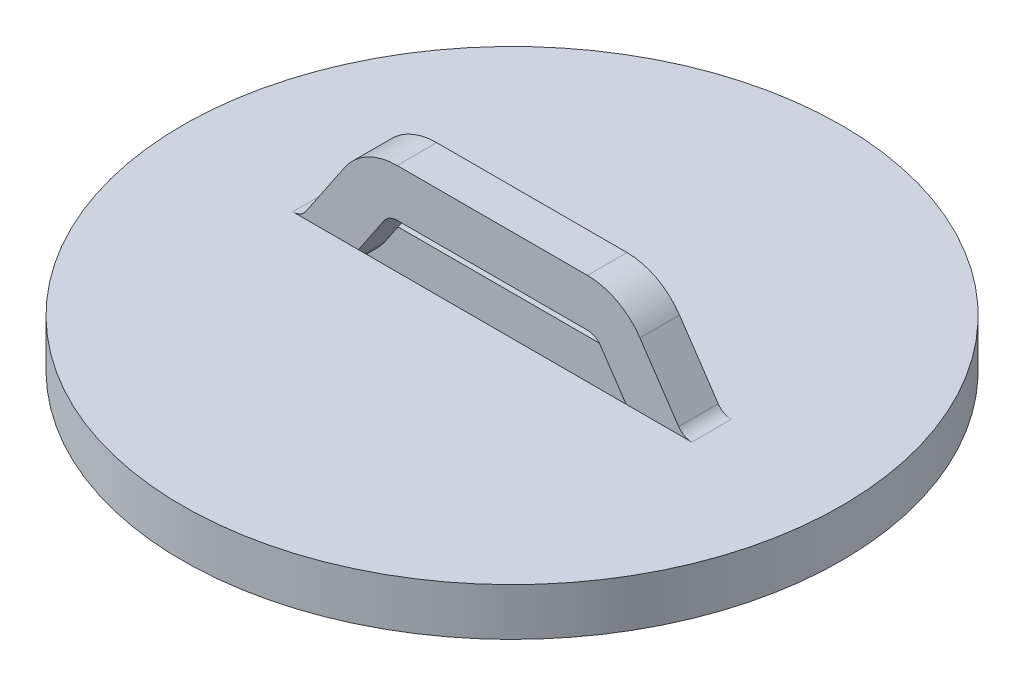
ISO-10303-21;
HEADER;
FILE_DESCRIPTION(('STEP AP214'),'2;1');
FILE_NAME('part.step','',(''),(''),'','','');
FILE_SCHEMA(('AUTOMOTIVE_DESIGN { 1 0 10303 214 1 1 1 1 }'));
ENDSEC;
DATA;
#1=APPLICATION_CONTEXT('core data for automotive mechanical design processes');
#2=APPLICATION_PROTOCOL_DEFINITION('international standard','automotive_design',2000,#1);
#3=PRODUCT_CONTEXT('',#1,'mechanical');
#4=PRODUCT('Part','Part','',(#3));
#5=PRODUCT_RELATED_PRODUCT_CATEGORY('part','',(#4));
#6=PRODUCT_DEFINITION_FORMATION('','',#4);
#7=PRODUCT_DEFINITION_CONTEXT('part definition',#1,'design');
#8=PRODUCT_DEFINITION('design','',#6,#7);
#9=PRODUCT_DEFINITION_SHAPE('','',#8);
#10=(LENGTH_UNIT() NAMED_UNIT(*) SI_UNIT(.MILLI.,.METRE.));
#11=(NAMED_UNIT(*) PLANE_ANGLE_UNIT() SI_UNIT($,.RADIAN.));
#12=(NAMED_UNIT(*) SI_UNIT($,.STERADIAN.) SOLID_ANGLE_UNIT());
#13=UNCERTAINTY_MEASURE_WITH_UNIT(LENGTH_MEASURE(1.E-05),#10,'distance_accuracy_value','');
#14=(GEOMETRIC_REPRESENTATION_CONTEXT(3) GLOBAL_UNCERTAINTY_ASSIGNED_CONTEXT((#13)) GLOBAL_UNIT_ASSIGNED_CONTEXT((#10,
#11,#12)) REPRESENTATION_CONTEXT('',''));
#15=CARTESIAN_POINT('',(0.,0.,0.));
#16=DIRECTION('',(0.,0.,1.));
#17=DIRECTION('',(1.,0.,0.));
#18=AXIS2_PLACEMENT_3D('',#15,#16,#17);
#19=CARTESIAN_POINT('',(-9.60870329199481,0.762,1.905));
#20=DIRECTION('',(0.,0.,-1.));
#21=DIRECTION('',(-1.,0.,0.));
#22=AXIS2_PLACEMENT_3D('',#19,#20,#21);
#23=PLANE('',#22);
#24=DIRECTION('',(-1.,0.,0.));
#25=VECTOR('',#24,1.);
#26=CARTESIAN_POINT('',(-9.60870329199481,0.,1.905));
#27=LINE('',#26,#25);
#28=CARTESIAN_POINT('',(-6.44612647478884,0.,1.905));
#29=VERTEX_POINT('',#28);
#30=CARTESIAN_POINT('',(-9.60870329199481,0.,1.905));
#31=VERTEX_POINT('',#30);
#32=EDGE_CURVE('E60',#29,#31,#27,.T.);
#33=ORIENTED_EDGE('',*,*,#32,.F.);
#34=DIRECTION('',(0.559192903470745,0.829037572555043,0.));
#35=VECTOR('',#34,1.);
#36=CARTESIAN_POINT('',(-7.08179677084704,-0.942419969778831,1.905));
#37=LINE('',#36,#35);
#38=CARTESIAN_POINT('',(-5.21642663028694,1.82310499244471,1.905));
#39=VERTEX_POINT('',#38);
#40=EDGE_CURVE('E267',#29,#39,#37,.T.);
#41=ORIENTED_EDGE('',*,*,#40,.T.);
#42=CARTESIAN_POINT('',(-4.5847,1.397,1.905));
#43=DIRECTION('',(0.,0.,-1.));
#44=DIRECTION('',(-1.,0.,0.));
#45=AXIS2_PLACEMENT_3D('',#42,#43,#44);
#46=CIRCLE('',#45,0.761999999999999);
#47=CARTESIAN_POINT('',(-4.5847,2.159,1.905));
#48=VERTEX_POINT('',#47);
#49=EDGE_CURVE('E270',#39,#48,#46,.T.);
#50=ORIENTED_EDGE('',*,*,#49,.T.);
#51=DIRECTION('',(1.,0.,0.));
#52=VECTOR('',#51,1.);
#53=CARTESIAN_POINT('',(-4.5847,2.159,1.905));
#54=LINE('',#53,#52);
#55=CARTESIAN_POINT('',(4.5847,2.159,1.905));
#56=VERTEX_POINT('',#55);
#57=EDGE_CURVE('E272',#48,#56,#54,.T.);
#58=ORIENTED_EDGE('',*,*,#57,.T.);
#59=CARTESIAN_POINT('',(4.5847,1.397,1.905));
#60=DIRECTION('',(0.,0.,-1.));
#61=DIRECTION('',(-1.,0.,0.));
#62=AXIS2_PLACEMENT_3D('',#59,#60,#61);
#63=CIRCLE('',#62,0.762);
#64=CARTESIAN_POINT('',(5.21642663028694,1.82310499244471,1.905));
#65=VERTEX_POINT('',#64);
#66=EDGE_CURVE('E274',#56,#65,#63,.T.);
#67=ORIENTED_EDGE('',*,*,#66,.T.);
#68=DIRECTION('',(0.559192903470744,-0.829037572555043,0.));
#69=VECTOR('',#68,1.);
#70=CARTESIAN_POINT('',(5.21642663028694,1.82310499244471,1.905));
#71=LINE('',#70,#69);
#72=CARTESIAN_POINT('',(6.44612647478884,0.,1.905));
#73=VERTEX_POINT('',#72);
#74=EDGE_CURVE('E276',#65,#73,#71,.T.);
#75=ORIENTED_EDGE('',*,*,#74,.T.);
#76=CARTESIAN_POINT('',(9.60870329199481,0.,1.905));
#77=VERTEX_POINT('',#76);
#78=EDGE_CURVE('E265',#77,#73,#27,.T.);
#79=ORIENTED_EDGE('',*,*,#78,.F.);
#80=CARTESIAN_POINT('',(9.60870329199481,0.762,1.905));
#81=DIRECTION('',(0.,0.,-1.));
#82=DIRECTION('',(1.,0.,0.));
#83=AXIS2_PLACEMENT_3D('',#80,#81,#82);
#84=CIRCLE('',#83,0.762);
#85=CARTESIAN_POINT('',(8.97697666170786,0.335895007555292,1.905));
#86=VERTEX_POINT('',#85);
#87=EDGE_CURVE('E279',#77,#86,#84,.T.);
#88=ORIENTED_EDGE('',*,*,#87,.T.);
#89=DIRECTION('',(-0.559192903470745,0.829037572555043,0.));
#90=VECTOR('',#89,1.);
#91=CARTESIAN_POINT('',(7.11160652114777,3.10141996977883,1.905));
#92=LINE('',#91,#90);
#93=CARTESIAN_POINT('',(7.11160652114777,3.10141996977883,1.905));
#94=VERTEX_POINT('',#93);
#95=EDGE_CURVE('E281',#86,#94,#92,.T.);
#96=ORIENTED_EDGE('',*,*,#95,.T.);
#97=CARTESIAN_POINT('',(4.5847,1.397,1.905));
#98=DIRECTION('',(0.,0.,1.));
#99=DIRECTION('',(-1.,0.,0.));
#100=AXIS2_PLACEMENT_3D('',#97,#98,#99);
#101=CIRCLE('',#100,3.048);
#102=CARTESIAN_POINT('',(4.5847,4.445,1.905));
#103=VERTEX_POINT('',#102);
#104=EDGE_CURVE('E283',#94,#103,#101,.T.);
#105=ORIENTED_EDGE('',*,*,#104,.T.);
#106=DIRECTION('',(-1.,0.,0.));
#107=VECTOR('',#106,1.);
#108=CARTESIAN_POINT('',(-4.5847,4.445,1.905));
#109=LINE('',#108,#107);
#110=CARTESIAN_POINT('',(-4.5847,4.445,1.905));
#111=VERTEX_POINT('',#110);
#112=EDGE_CURVE('E285',#103,#111,#109,.T.);
#113=ORIENTED_EDGE('',*,*,#112,.T.);
#114=CARTESIAN_POINT('',(-4.5847,1.397,1.905));
#115=DIRECTION('',(0.,0.,1.));
#116=DIRECTION('',(-1.,0.,0.));
#117=AXIS2_PLACEMENT_3D('',#114,#115,#116);
#118=CIRCLE('',#117,3.048);
#119=CARTESIAN_POINT('',(-7.11160652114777,3.10141996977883,1.905));
#120=VERTEX_POINT('',#119);
#121=EDGE_CURVE('E287',#111,#120,#118,.T.);
#122=ORIENTED_EDGE('',*,*,#121,.T.);
#123=DIRECTION('',(-0.559192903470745,-0.829037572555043,0.));
#124=VECTOR('',#123,1.);
#125=CARTESIAN_POINT('',(-8.97697666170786,0.335895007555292,1.905));
#126=LINE('',#125,#124);
#127=CARTESIAN_POINT('',(-8.97697666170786,0.335895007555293,1.905));
#128=VERTEX_POINT('',#127);
#129=EDGE_CURVE('E195',#120,#128,#126,.T.);
#130=ORIENTED_EDGE('',*,*,#129,.T.);
#131=CARTESIAN_POINT('',(-9.60870329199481,0.762,1.905));
#132=DIRECTION('',(0.,0.,-1.));
#133=DIRECTION('',(-1.,0.,0.));
#134=AXIS2_PLACEMENT_3D('',#131,#132,#133);
#135=CIRCLE('',#134,0.762);
#136=EDGE_CURVE('E191',#128,#31,#135,.T.);
#137=ORIENTED_EDGE('',*,*,#136,.T.);
#138=EDGE_LOOP('',(#33,#41,#50,#58,#67,#75,#79,#88,#96,#105,#113,#122,#130,#137));
#139=FACE_BOUND('',#138,.T.);
#140=ADVANCED_FACE('F37',(#139),#23,.F.);
#141=CARTESIAN_POINT('',(-9.60870329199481,0.762,0.));
#142=DIRECTION('',(0.,0.,-1.));
#143=DIRECTION('',(-1.,0.,0.));
#144=AXIS2_PLACEMENT_3D('',#141,#142,#143);
#145=PLANE('',#144);
#146=DIRECTION('',(0.559192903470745,0.829037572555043,0.));
#147=VECTOR('',#146,1.);
#148=CARTESIAN_POINT('',(-7.08179677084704,-0.942419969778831,0.));
#149=LINE('',#148,#147);
#150=CARTESIAN_POINT('',(-6.44612647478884,0.,0.));
#151=VERTEX_POINT('',#150);
#152=CARTESIAN_POINT('',(-5.21642663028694,1.82310499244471,0.));
#153=VERTEX_POINT('',#152);
#154=EDGE_CURVE('E170',#151,#153,#149,.T.);
#155=ORIENTED_EDGE('',*,*,#154,.F.);
#156=DIRECTION('',(1.,0.,0.));
#157=VECTOR('',#156,1.);
#158=CARTESIAN_POINT('',(-9.60870329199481,0.,0.));
#159=LINE('',#158,#157);
#160=CARTESIAN_POINT('',(-9.60870329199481,0.,0.));
#161=VERTEX_POINT('',#160);
#162=EDGE_CURVE('E164',#161,#151,#159,.T.);
#163=ORIENTED_EDGE('',*,*,#162,.F.);
#164=CARTESIAN_POINT('',(-9.60870329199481,0.762,0.));
#165=DIRECTION('',(0.,0.,-1.));
#166=DIRECTION('',(-1.,0.,0.));
#167=AXIS2_PLACEMENT_3D('',#164,#165,#166);
#168=CIRCLE('',#167,0.762);
#169=CARTESIAN_POINT('',(-8.97697666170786,0.335895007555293,0.));
#170=VERTEX_POINT('',#169);
#171=EDGE_CURVE('E168',#170,#161,#168,.T.);
#172=ORIENTED_EDGE('',*,*,#171,.F.);
#173=DIRECTION('',(-0.559192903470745,-0.829037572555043,0.));
#174=VECTOR('',#173,1.);
#175=CARTESIAN_POINT('',(-8.97697666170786,0.335895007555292,0.));
#176=LINE('',#175,#174);
#177=CARTESIAN_POINT('',(-7.11160652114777,3.10141996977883,0.));
#178=VERTEX_POINT('',#177);
#179=EDGE_CURVE('E186',#178,#170,#176,.T.);
#180=ORIENTED_EDGE('',*,*,#179,.F.);
#181=CARTESIAN_POINT('',(-4.5847,1.397,0.));
#182=DIRECTION('',(0.,0.,1.));
#183=DIRECTION('',(-1.,0.,0.));
#184=AXIS2_PLACEMENT_3D('',#181,#182,#183);
#185=CIRCLE('',#184,3.048);
#186=CARTESIAN_POINT('',(-4.5847,4.445,0.));
#187=VERTEX_POINT('',#186);
#188=EDGE_CURVE('E314',#187,#178,#185,.T.);
#189=ORIENTED_EDGE('',*,*,#188,.F.);
#190=DIRECTION('',(-1.,0.,0.));
#191=VECTOR('',#190,1.);
#192=CARTESIAN_POINT('',(-4.5847,4.445,0.));
#193=LINE('',#192,#191);
#194=CARTESIAN_POINT('',(4.5847,4.445,0.));
#195=VERTEX_POINT('',#194);
#196=EDGE_CURVE('E312',#195,#187,#193,.T.);
#197=ORIENTED_EDGE('',*,*,#196,.F.);
#198=CARTESIAN_POINT('',(4.5847,1.397,0.));
#199=DIRECTION('',(0.,0.,1.));
#200=DIRECTION('',(-1.,0.,0.));
#201=AXIS2_PLACEMENT_3D('',#198,#199,#200);
#202=CIRCLE('',#201,3.048);
#203=CARTESIAN_POINT('',(7.11160652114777,3.10141996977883,0.));
#204=VERTEX_POINT('',#203);
#205=EDGE_CURVE('E310',#204,#195,#202,.T.);
#206=ORIENTED_EDGE('',*,*,#205,.F.);
#207=DIRECTION('',(-0.559192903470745,0.829037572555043,0.));
#208=VECTOR('',#207,1.);
#209=CARTESIAN_POINT('',(7.11160652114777,3.10141996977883,0.));
#210=LINE('',#209,#208);
#211=CARTESIAN_POINT('',(8.97697666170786,0.335895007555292,0.));
#212=VERTEX_POINT('',#211);
#213=EDGE_CURVE('E308',#212,#204,#210,.T.);
#214=ORIENTED_EDGE('',*,*,#213,.F.);
#215=CARTESIAN_POINT('',(9.60870329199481,0.762,0.));
#216=DIRECTION('',(0.,0.,-1.));
#217=DIRECTION('',(1.,0.,0.));
#218=AXIS2_PLACEMENT_3D('',#215,#216,#217);
#219=CIRCLE('',#218,0.762);
#220=CARTESIAN_POINT('',(9.60870329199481,0.,0.));
#221=VERTEX_POINT('',#220);
#222=EDGE_CURVE('E306',#221,#212,#219,.T.);
#223=ORIENTED_EDGE('',*,*,#222,.F.);
#224=DIRECTION('',(-1.,0.,0.));
#225=VECTOR('',#224,1.);
#226=CARTESIAN_POINT('',(-9.60870329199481,0.,0.));
#227=LINE('',#226,#225);
#228=CARTESIAN_POINT('',(6.44612647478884,0.,0.));
#229=VERTEX_POINT('',#228);
#230=EDGE_CURVE('E11',#221,#229,#227,.T.);
#231=ORIENTED_EDGE('',*,*,#230,.T.);
#232=DIRECTION('',(0.559192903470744,-0.829037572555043,0.));
#233=VECTOR('',#232,1.);
#234=CARTESIAN_POINT('',(5.21642663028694,1.82310499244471,0.));
#235=LINE('',#234,#233);
#236=CARTESIAN_POINT('',(5.21642663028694,1.82310499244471,0.));
#237=VERTEX_POINT('',#236);
#238=EDGE_CURVE('E300',#237,#229,#235,.T.);
#239=ORIENTED_EDGE('',*,*,#238,.F.);
#240=CARTESIAN_POINT('',(4.5847,1.397,0.));
#241=DIRECTION('',(0.,0.,-1.));
#242=DIRECTION('',(-1.,0.,0.));
#243=AXIS2_PLACEMENT_3D('',#240,#241,#242);
#244=CIRCLE('',#243,0.762);
#245=CARTESIAN_POINT('',(4.5847,2.159,0.));
#246=VERTEX_POINT('',#245);
#247=EDGE_CURVE('E297',#246,#237,#244,.T.);
#248=ORIENTED_EDGE('',*,*,#247,.F.);
#249=DIRECTION('',(1.,0.,0.));
#250=VECTOR('',#249,1.);
#251=CARTESIAN_POINT('',(-4.5847,2.159,0.));
#252=LINE('',#251,#250);
#253=CARTESIAN_POINT('',(-4.5847,2.159,0.));
#254=VERTEX_POINT('',#253);
#255=EDGE_CURVE('E295',#254,#246,#252,.T.);
#256=ORIENTED_EDGE('',*,*,#255,.F.);
#257=CARTESIAN_POINT('',(-4.5847,1.397,0.));
#258=DIRECTION('',(0.,0.,-1.));
#259=DIRECTION('',(-1.,0.,0.));
#260=AXIS2_PLACEMENT_3D('',#257,#258,#259);
#261=CIRCLE('',#260,0.761999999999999);
#262=EDGE_CURVE('E293',#153,#254,#261,.T.);
#263=ORIENTED_EDGE('',*,*,#262,.F.);
#264=EDGE_LOOP('',(#155,#163,#172,#180,#189,#197,#206,#214,#223,#231,#239,#248,#256,#263));
#265=FACE_BOUND('',#264,.T.);
#266=ADVANCED_FACE('F166',(#265),#145,.T.);
#267=CARTESIAN_POINT('',(-9.60870329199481,0.762,1.905));
#268=DIRECTION('',(0.,0.,-1.));
#269=DIRECTION('',(-1.,0.,0.));
#270=AXIS2_PLACEMENT_3D('',#267,#268,#269);
#271=CYLINDRICAL_SURFACE('',#270,3.048);
#272=CARTESIAN_POINT('',(-9.60870329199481,0.762,0.));
#273=DIRECTION('',(0.,0.,1.));
#274=DIRECTION('',(-1.,0.,0.));
#275=AXIS2_PLACEMENT_3D('',#272,#273,#274);
#276=CIRCLE('',#275,3.048);
#277=CARTESIAN_POINT('',(-9.60870329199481,-2.286,0.));
#278=VERTEX_POINT('',#277);
#279=CARTESIAN_POINT('',(-7.08179677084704,-0.942419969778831,0.));
#280=VERTEX_POINT('',#279);
#281=EDGE_CURVE('E241',#278,#280,#276,.T.);
#282=ORIENTED_EDGE('',*,*,#281,.T.);
#283=DIRECTION('',(0.,0.,-1.));
#284=VECTOR('',#283,1.);
#285=CARTESIAN_POINT('',(-7.08179677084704,-0.942419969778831,1.905));
#286=LINE('',#285,#284);
#287=CARTESIAN_POINT('',(-7.08179677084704,-0.942419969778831,1.905));
#288=VERTEX_POINT('',#287);
#289=EDGE_CURVE('E234',#288,#280,#286,.T.);
#290=ORIENTED_EDGE('',*,*,#289,.F.);
#291=CARTESIAN_POINT('',(-9.60870329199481,0.762,1.905));
#292=DIRECTION('',(0.,0.,1.));
#293=DIRECTION('',(-1.,0.,0.));
#294=AXIS2_PLACEMENT_3D('',#291,#292,#293);
#295=CIRCLE('',#294,3.048);
#296=CARTESIAN_POINT('',(-9.60870329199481,-2.286,1.905));
#297=VERTEX_POINT('',#296);
#298=EDGE_CURVE('E185',#297,#288,#295,.T.);
#299=ORIENTED_EDGE('',*,*,#298,.F.);
#300=DIRECTION('',(0.,0.,-1.));
#301=VECTOR('',#300,1.);
#302=CARTESIAN_POINT('',(-9.60870329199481,-2.286,1.905));
#303=LINE('',#302,#301);
#304=EDGE_CURVE('E45',#297,#278,#303,.T.);
#305=ORIENTED_EDGE('',*,*,#304,.T.);
#306=EDGE_LOOP('',(#282,#290,#299,#305));
#307=FACE_BOUND('',#306,.T.);
#308=ADVANCED_FACE('F39',(#307),#271,.T.);
#309=CARTESIAN_POINT('',(-7.08179677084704,-0.942419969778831,1.905));
#310=DIRECTION('',(-0.829037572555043,0.559192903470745,0.));
#311=DIRECTION('',(-0.559192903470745,-0.829037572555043,0.));
#312=AXIS2_PLACEMENT_3D('',#309,#310,#311);
#313=PLANE('',#312);
#314=EDGE_CURVE('E291',#280,#151,#149,.T.);
#315=ORIENTED_EDGE('',*,*,#314,.T.);
#316=ORIENTED_EDGE('',*,*,#154,.T.);
#317=DIRECTION('',(0.,0.,-1.));
#318=VECTOR('',#317,1.);
#319=CARTESIAN_POINT('',(-5.21642663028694,1.82310499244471,1.905));
#320=LINE('',#319,#318);
#321=EDGE_CURVE('E231',#39,#153,#320,.T.);
#322=ORIENTED_EDGE('',*,*,#321,.F.);
#323=ORIENTED_EDGE('',*,*,#40,.F.);
#324=EDGE_CURVE('E268',#288,#29,#37,.T.);
#325=ORIENTED_EDGE('',*,*,#324,.F.);
#326=ORIENTED_EDGE('',*,*,#289,.T.);
#327=EDGE_LOOP('',(#315,#316,#322,#323,#325,#326));
#328=FACE_BOUND('',#327,.T.);
#329=ADVANCED_FACE('F363',(#328),#313,.F.);
#330=CARTESIAN_POINT('',(-4.5847,1.397,1.905));
#331=DIRECTION('',(0.,0.,-1.));
#332=DIRECTION('',(-1.,0.,0.));
#333=AXIS2_PLACEMENT_3D('',#330,#331,#332);
#334=CYLINDRICAL_SURFACE('',#333,0.761999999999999);
#335=ORIENTED_EDGE('',*,*,#262,.T.);
#336=DIRECTION('',(0.,0.,-1.));
#337=VECTOR('',#336,1.);
#338=CARTESIAN_POINT('',(-4.5847,2.159,1.905));
#339=LINE('',#338,#337);
#340=EDGE_CURVE('E228',#48,#254,#339,.T.);
#341=ORIENTED_EDGE('',*,*,#340,.F.);
#342=ORIENTED_EDGE('',*,*,#49,.F.);
#343=ORIENTED_EDGE('',*,*,#321,.T.);
#344=EDGE_LOOP('',(#335,#341,#342,#343));
#345=FACE_BOUND('',#344,.T.);
#346=ADVANCED_FACE('F360',(#345),#334,.F.);
#347=CARTESIAN_POINT('',(-4.5847,2.159,1.905));
#348=DIRECTION('',(0.,1.,0.));
#349=DIRECTION('',(-1.,0.,0.));
#350=AXIS2_PLACEMENT_3D('',#347,#348,#349);
#351=PLANE('',#350);
#352=ORIENTED_EDGE('',*,*,#255,.T.);
#353=DIRECTION('',(0.,0.,-1.));
#354=VECTOR('',#353,1.);
#355=CARTESIAN_POINT('',(4.5847,2.159,1.905));
#356=LINE('',#355,#354);
#357=EDGE_CURVE('E225',#56,#246,#356,.T.);
#358=ORIENTED_EDGE('',*,*,#357,.F.);
#359=ORIENTED_EDGE('',*,*,#57,.F.);
#360=ORIENTED_EDGE('',*,*,#340,.T.);
#361=EDGE_LOOP('',(#352,#358,#359,#360));
#362=FACE_BOUND('',#361,.T.);
#363=ADVANCED_FACE('F355',(#362),#351,.F.);
#364=CARTESIAN_POINT('',(4.5847,1.397,1.905));
#365=DIRECTION('',(0.,0.,-1.));
#366=DIRECTION('',(-1.,0.,0.));
#367=AXIS2_PLACEMENT_3D('',#364,#365,#366);
#368=CYLINDRICAL_SURFACE('',#367,0.762);
#369=ORIENTED_EDGE('',*,*,#247,.T.);
#370=DIRECTION('',(0.,0.,-1.));
#371=VECTOR('',#370,1.);
#372=CARTESIAN_POINT('',(5.21642663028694,1.82310499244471,1.905));
#373=LINE('',#372,#371);
#374=EDGE_CURVE('E222',#65,#237,#373,.T.);
#375=ORIENTED_EDGE('',*,*,#374,.F.);
#376=ORIENTED_EDGE('',*,*,#66,.F.);
#377=ORIENTED_EDGE('',*,*,#357,.T.);
#378=EDGE_LOOP('',(#369,#375,#376,#377));
#379=FACE_BOUND('',#378,.T.);
#380=ADVANCED_FACE('F351',(#379),#368,.F.);
#381=CARTESIAN_POINT('',(5.21642663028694,1.82310499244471,1.905));
#382=DIRECTION('',(0.829037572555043,0.559192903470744,0.));
#383=DIRECTION('',(-0.559192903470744,0.829037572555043,0.));
#384=AXIS2_PLACEMENT_3D('',#381,#382,#383);
#385=PLANE('',#384);
#386=ORIENTED_EDGE('',*,*,#238,.T.);
#387=CARTESIAN_POINT('',(7.08179677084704,-0.94241996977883,0.));
#388=VERTEX_POINT('',#387);
#389=EDGE_CURVE('E299',#229,#388,#235,.T.);
#390=ORIENTED_EDGE('',*,*,#389,.T.);
#391=DIRECTION('',(0.,0.,-1.));
#392=VECTOR('',#391,1.);
#393=CARTESIAN_POINT('',(7.08179677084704,-0.94241996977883,1.905));
#394=LINE('',#393,#392);
#395=CARTESIAN_POINT('',(7.08179677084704,-0.94241996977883,1.905));
#396=VERTEX_POINT('',#395);
#397=EDGE_CURVE('E219',#396,#388,#394,.T.);
#398=ORIENTED_EDGE('',*,*,#397,.F.);
#399=EDGE_CURVE('E52',#73,#396,#71,.T.);
#400=ORIENTED_EDGE('',*,*,#399,.F.);
#401=ORIENTED_EDGE('',*,*,#74,.F.);
#402=ORIENTED_EDGE('',*,*,#374,.T.);
#403=EDGE_LOOP('',(#386,#390,#398,#400,#401,#402));
#404=FACE_BOUND('',#403,.T.);
#405=ADVANCED_FACE('F347',(#404),#385,.F.);
#406=CARTESIAN_POINT('',(9.60870329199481,0.762,1.905));
#407=DIRECTION('',(0.,0.,-1.));
#408=DIRECTION('',(-1.,0.,0.));
#409=AXIS2_PLACEMENT_3D('',#406,#407,#408);
#410=CYLINDRICAL_SURFACE('',#409,3.048);
#411=CARTESIAN_POINT('',(9.60870329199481,0.762,0.));
#412=DIRECTION('',(0.,0.,1.));
#413=DIRECTION('',(1.,0.,0.));
#414=AXIS2_PLACEMENT_3D('',#411,#412,#413);
#415=CIRCLE('',#414,3.048);
#416=CARTESIAN_POINT('',(9.60870329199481,-2.286,0.));
#417=VERTEX_POINT('',#416);
#418=EDGE_CURVE('E303',#388,#417,#415,.T.);
#419=ORIENTED_EDGE('',*,*,#418,.T.);
#420=DIRECTION('',(0.,0.,-1.));
#421=VECTOR('',#420,1.);
#422=CARTESIAN_POINT('',(9.60870329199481,-2.286,1.905));
#423=LINE('',#422,#421);
#424=CARTESIAN_POINT('',(9.60870329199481,-2.286,1.905));
#425=VERTEX_POINT('',#424);
#426=EDGE_CURVE('E216',#425,#417,#423,.T.);
#427=ORIENTED_EDGE('',*,*,#426,.F.);
#428=CARTESIAN_POINT('',(9.60870329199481,0.762,1.905));
#429=DIRECTION('',(0.,0.,1.));
#430=DIRECTION('',(1.,0.,0.));
#431=AXIS2_PLACEMENT_3D('',#428,#429,#430);
#432=CIRCLE('',#431,3.048);
#433=EDGE_CURVE('E254',#396,#425,#432,.T.);
#434=ORIENTED_EDGE('',*,*,#433,.F.);
#435=ORIENTED_EDGE('',*,*,#397,.T.);
#436=EDGE_LOOP('',(#419,#427,#434,#435));
#437=FACE_BOUND('',#436,.T.);
#438=ADVANCED_FACE('F368',(#437),#410,.T.);
#439=CARTESIAN_POINT('',(9.60870329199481,-2.286,1.905));
#440=DIRECTION('',(0.,1.,0.));
#441=DIRECTION('',(0.,0.,1.));
#442=AXIS2_PLACEMENT_3D('',#439,#440,#441);
#443=PLANE('',#442);
#444=CARTESIAN_POINT('',(0.,-2.286,0.9525));
#445=DIRECTION('',(0.,-1.,0.));
#446=DIRECTION('',(0.,0.,-1.));
#447=AXIS2_PLACEMENT_3D('',#444,#445,#446);
#448=CIRCLE('',#447,15.875);
#449=CARTESIAN_POINT('',(0.,-2.286,-14.9225));
#450=VERTEX_POINT('',#449);
#451=EDGE_CURVE('E262',#450,#450,#448,.T.);
#452=ORIENTED_EDGE('',*,*,#451,.T.);
#453=EDGE_LOOP('',(#452));
#454=FACE_BOUND('',#453,.T.);
#455=DIRECTION('',(-1.,0.,0.));
#456=VECTOR('',#455,1.);
#457=CARTESIAN_POINT('',(-9.60870329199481,-2.286,1.905));
#458=LINE('',#457,#456);
#459=EDGE_CURVE('E247',#425,#297,#458,.T.);
#460=ORIENTED_EDGE('',*,*,#459,.F.);
#461=ORIENTED_EDGE('',*,*,#426,.T.);
#462=DIRECTION('',(1.,0.,0.));
#463=VECTOR('',#462,1.);
#464=CARTESIAN_POINT('',(-9.60870329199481,-2.286,0.));
#465=LINE('',#464,#463);
#466=EDGE_CURVE('E248',#278,#417,#465,.T.);
#467=ORIENTED_EDGE('',*,*,#466,.F.);
#468=ORIENTED_EDGE('',*,*,#304,.F.);
#469=EDGE_LOOP('',(#460,#461,#467,#468));
#470=FACE_BOUND('',#469,.T.);
#471=ADVANCED_FACE('F246',(#454,#470),#443,.F.);
#472=CARTESIAN_POINT('',(9.60870329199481,0.762,1.905));
#473=DIRECTION('',(0.,0.,-1.));
#474=DIRECTION('',(-1.,0.,0.));
#475=AXIS2_PLACEMENT_3D('',#472,#473,#474);
#476=CYLINDRICAL_SURFACE('',#475,0.762);
#477=ORIENTED_EDGE('',*,*,#222,.T.);
#478=DIRECTION('',(0.,0.,-1.));
#479=VECTOR('',#478,1.);
#480=CARTESIAN_POINT('',(8.97697666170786,0.335895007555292,1.905));
#481=LINE('',#480,#479);
#482=EDGE_CURVE('E210',#86,#212,#481,.T.);
#483=ORIENTED_EDGE('',*,*,#482,.F.);
#484=ORIENTED_EDGE('',*,*,#87,.F.);
#485=DIRECTION('',(0.,0.,-1.));
#486=VECTOR('',#485,1.);
#487=CARTESIAN_POINT('',(9.60870329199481,0.,1.905));
#488=LINE('',#487,#486);
#489=EDGE_CURVE('E213',#77,#221,#488,.T.);
#490=ORIENTED_EDGE('',*,*,#489,.T.);
#491=EDGE_LOOP('',(#477,#483,#484,#490));
#492=FACE_BOUND('',#491,.T.);
#493=ADVANCED_FACE('F342',(#492),#476,.F.);
#494=CARTESIAN_POINT('',(7.11160652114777,3.10141996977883,1.905));
#495=DIRECTION('',(-0.829037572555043,-0.559192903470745,0.));
#496=DIRECTION('',(0.559192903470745,-0.829037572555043,0.));
#497=AXIS2_PLACEMENT_3D('',#494,#495,#496);
#498=PLANE('',#497);
#499=ORIENTED_EDGE('',*,*,#213,.T.);
#500=DIRECTION('',(0.,0.,-1.));
#501=VECTOR('',#500,1.);
#502=CARTESIAN_POINT('',(7.11160652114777,3.10141996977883,1.905));
#503=LINE('',#502,#501);
#504=EDGE_CURVE('E207',#94,#204,#503,.T.);
#505=ORIENTED_EDGE('',*,*,#504,.F.);
#506=ORIENTED_EDGE('',*,*,#95,.F.);
#507=ORIENTED_EDGE('',*,*,#482,.T.);
#508=EDGE_LOOP('',(#499,#505,#506,#507));
#509=FACE_BOUND('',#508,.T.);
#510=ADVANCED_FACE('F337',(#509),#498,.F.);
#511=CARTESIAN_POINT('',(4.5847,1.397,1.905));
#512=DIRECTION('',(0.,0.,-1.));
#513=DIRECTION('',(-1.,0.,0.));
#514=AXIS2_PLACEMENT_3D('',#511,#512,#513);
#515=CYLINDRICAL_SURFACE('',#514,3.048);
#516=ORIENTED_EDGE('',*,*,#205,.T.);
#517=DIRECTION('',(0.,0.,-1.));
#518=VECTOR('',#517,1.);
#519=CARTESIAN_POINT('',(4.5847,4.445,1.905));
#520=LINE('',#519,#518);
#521=EDGE_CURVE('E204',#103,#195,#520,.T.);
#522=ORIENTED_EDGE('',*,*,#521,.F.);
#523=ORIENTED_EDGE('',*,*,#104,.F.);
#524=ORIENTED_EDGE('',*,*,#504,.T.);
#525=EDGE_LOOP('',(#516,#522,#523,#524));
#526=FACE_BOUND('',#525,.T.);
#527=ADVANCED_FACE('F332',(#526),#515,.T.);
#528=CARTESIAN_POINT('',(-4.5847,4.445,1.905));
#529=DIRECTION('',(0.,-1.,0.));
#530=DIRECTION('',(0.,0.,-1.));
#531=AXIS2_PLACEMENT_3D('',#528,#529,#530);
#532=PLANE('',#531);
#533=ORIENTED_EDGE('',*,*,#196,.T.);
#534=DIRECTION('',(0.,0.,-1.));
#535=VECTOR('',#534,1.);
#536=CARTESIAN_POINT('',(-4.5847,4.445,1.905));
#537=LINE('',#536,#535);
#538=EDGE_CURVE('E201',#111,#187,#537,.T.);
#539=ORIENTED_EDGE('',*,*,#538,.F.);
#540=ORIENTED_EDGE('',*,*,#112,.F.);
#541=ORIENTED_EDGE('',*,*,#521,.T.);
#542=EDGE_LOOP('',(#533,#539,#540,#541));
#543=FACE_BOUND('',#542,.T.);
#544=ADVANCED_FACE('F328',(#543),#532,.F.);
#545=CARTESIAN_POINT('',(-4.5847,1.397,1.905));
#546=DIRECTION('',(0.,0.,-1.));
#547=DIRECTION('',(-1.,0.,0.));
#548=AXIS2_PLACEMENT_3D('',#545,#546,#547);
#549=CYLINDRICAL_SURFACE('',#548,3.048);
#550=ORIENTED_EDGE('',*,*,#188,.T.);
#551=DIRECTION('',(0.,0.,-1.));
#552=VECTOR('',#551,1.);
#553=CARTESIAN_POINT('',(-7.11160652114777,3.10141996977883,1.905));
#554=LINE('',#553,#552);
#555=EDGE_CURVE('E193',#120,#178,#554,.T.);
#556=ORIENTED_EDGE('',*,*,#555,.F.);
#557=ORIENTED_EDGE('',*,*,#121,.F.);
#558=ORIENTED_EDGE('',*,*,#538,.T.);
#559=EDGE_LOOP('',(#550,#556,#557,#558));
#560=FACE_BOUND('',#559,.T.);
#561=ADVANCED_FACE('F323',(#560),#549,.T.);
#562=CARTESIAN_POINT('',(-8.97697666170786,0.335895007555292,1.905));
#563=DIRECTION('',(0.829037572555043,-0.559192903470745,0.));
#564=DIRECTION('',(0.559192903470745,0.829037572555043,0.));
#565=AXIS2_PLACEMENT_3D('',#562,#563,#564);
#566=PLANE('',#565);
#567=ORIENTED_EDGE('',*,*,#179,.T.);
#568=DIRECTION('',(0.,0.,-1.));
#569=VECTOR('',#568,1.);
#570=CARTESIAN_POINT('',(-8.97697666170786,0.335895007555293,1.905));
#571=LINE('',#570,#569);
#572=EDGE_CURVE('E184',#128,#170,#571,.T.);
#573=ORIENTED_EDGE('',*,*,#572,.F.);
#574=ORIENTED_EDGE('',*,*,#129,.F.);
#575=ORIENTED_EDGE('',*,*,#555,.T.);
#576=EDGE_LOOP('',(#567,#573,#574,#575));
#577=FACE_BOUND('',#576,.T.);
#578=ADVANCED_FACE('F316',(#577),#566,.F.);
#579=CARTESIAN_POINT('',(-9.60870329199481,0.762,1.905));
#580=DIRECTION('',(0.,0.,-1.));
#581=DIRECTION('',(-1.,0.,0.));
#582=AXIS2_PLACEMENT_3D('',#579,#580,#581);
#583=CYLINDRICAL_SURFACE('',#582,0.762);
#584=ORIENTED_EDGE('',*,*,#171,.T.);
#585=DIRECTION('',(0.,0.,-1.));
#586=VECTOR('',#585,1.);
#587=CARTESIAN_POINT('',(-9.60870329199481,0.,1.905));
#588=LINE('',#587,#586);
#589=EDGE_CURVE('E182',#31,#161,#588,.T.);
#590=ORIENTED_EDGE('',*,*,#589,.F.);
#591=ORIENTED_EDGE('',*,*,#136,.F.);
#592=ORIENTED_EDGE('',*,*,#572,.T.);
#593=EDGE_LOOP('',(#584,#590,#591,#592));
#594=FACE_BOUND('',#593,.T.);
#595=ADVANCED_FACE('F180',(#594),#583,.F.);
#596=CARTESIAN_POINT('',(-15.875,0.,1.905));
#597=DIRECTION('',(0.,-1.,0.));
#598=DIRECTION('',(0.,0.,-1.));
#599=AXIS2_PLACEMENT_3D('',#596,#597,#598);
#600=PLANE('',#599);
#601=CARTESIAN_POINT('',(0.,0.,0.9525));
#602=DIRECTION('',(0.,-1.,0.));
#603=DIRECTION('',(0.,0.,-1.));
#604=AXIS2_PLACEMENT_3D('',#601,#602,#603);
#605=CIRCLE('',#604,15.875);
#606=CARTESIAN_POINT('',(0.,0.,-14.9225));
#607=VERTEX_POINT('',#606);
#608=EDGE_CURVE('E259',#607,#607,#605,.T.);
#609=ORIENTED_EDGE('',*,*,#608,.F.);
#610=EDGE_LOOP('',(#609));
#611=FACE_BOUND('',#610,.T.);
#612=ORIENTED_EDGE('',*,*,#489,.F.);
#613=ORIENTED_EDGE('',*,*,#78,.T.);
#614=EDGE_CURVE('E370',#73,#29,#27,.T.);
#615=ORIENTED_EDGE('',*,*,#614,.T.);
#616=ORIENTED_EDGE('',*,*,#32,.T.);
#617=ORIENTED_EDGE('',*,*,#589,.T.);
#618=ORIENTED_EDGE('',*,*,#162,.T.);
#619=EDGE_CURVE('E175',#151,#229,#159,.T.);
#620=ORIENTED_EDGE('',*,*,#619,.T.);
#621=ORIENTED_EDGE('',*,*,#230,.F.);
#622=EDGE_LOOP('',(#612,#613,#615,#616,#617,#618,#620,#621));
#623=FACE_BOUND('',#622,.T.);
#624=ADVANCED_FACE('F189',(#611,#623),#600,.F.);
#625=CARTESIAN_POINT('',(0.,0.,0.9525));
#626=DIRECTION('',(0.,-1.,0.));
#627=DIRECTION('',(0.,0.,-1.));
#628=AXIS2_PLACEMENT_3D('',#625,#626,#627);
#629=CYLINDRICAL_SURFACE('',#628,15.875);
#630=ORIENTED_EDGE('',*,*,#451,.F.);
#631=EDGE_LOOP('',(#630));
#632=FACE_BOUND('',#631,.T.);
#633=ORIENTED_EDGE('',*,*,#608,.T.);
#634=EDGE_LOOP('',(#633));
#635=FACE_BOUND('',#634,.T.);
#636=ADVANCED_FACE('F387',(#632,#635),#629,.T.);
#637=CARTESIAN_POINT('',(-9.60870329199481,0.,0.));
#638=DIRECTION('',(0.,0.,-1.));
#639=DIRECTION('',(-1.,0.,0.));
#640=AXIS2_PLACEMENT_3D('',#637,#638,#639);
#641=PLANE('',#640);
#642=ORIENTED_EDGE('',*,*,#314,.F.);
#643=ORIENTED_EDGE('',*,*,#281,.F.);
#644=ORIENTED_EDGE('',*,*,#466,.T.);
#645=ORIENTED_EDGE('',*,*,#418,.F.);
#646=ORIENTED_EDGE('',*,*,#389,.F.);
#647=ORIENTED_EDGE('',*,*,#619,.F.);
#648=EDGE_LOOP('',(#642,#643,#644,#645,#646,#647));
#649=FACE_BOUND('',#648,.T.);
#650=ADVANCED_FACE('F366',(#649),#641,.F.);
#651=CARTESIAN_POINT('',(-9.60870329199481,0.,1.905));
#652=DIRECTION('',(0.,0.,1.));
#653=DIRECTION('',(1.,0.,0.));
#654=AXIS2_PLACEMENT_3D('',#651,#652,#653);
#655=PLANE('',#654);
#656=ORIENTED_EDGE('',*,*,#459,.T.);
#657=ORIENTED_EDGE('',*,*,#298,.T.);
#658=ORIENTED_EDGE('',*,*,#324,.T.);
#659=ORIENTED_EDGE('',*,*,#614,.F.);
#660=ORIENTED_EDGE('',*,*,#399,.T.);
#661=ORIENTED_EDGE('',*,*,#433,.T.);
#662=EDGE_LOOP('',(#656,#657,#658,#659,#660,#661));
#663=FACE_BOUND('',#662,.T.);
#664=ADVANCED_FACE('F251',(#663),#655,.F.);
#665=CLOSED_SHELL('',(#140,#266,#308,#329,#346,#363,#380,#405,#438,#471,#493,#510,#527,#544,
#561,#578,#595,#624,#636,#650,#664));
#666=MANIFOLD_SOLID_BREP('B2',#665);
#667=ADVANCED_BREP_SHAPE_REPRESENTATION('',(#18,#666),#14);
#668=SHAPE_DEFINITION_REPRESENTATION(#9,#667);
ENDSEC;
END-ISO-10303-21;
